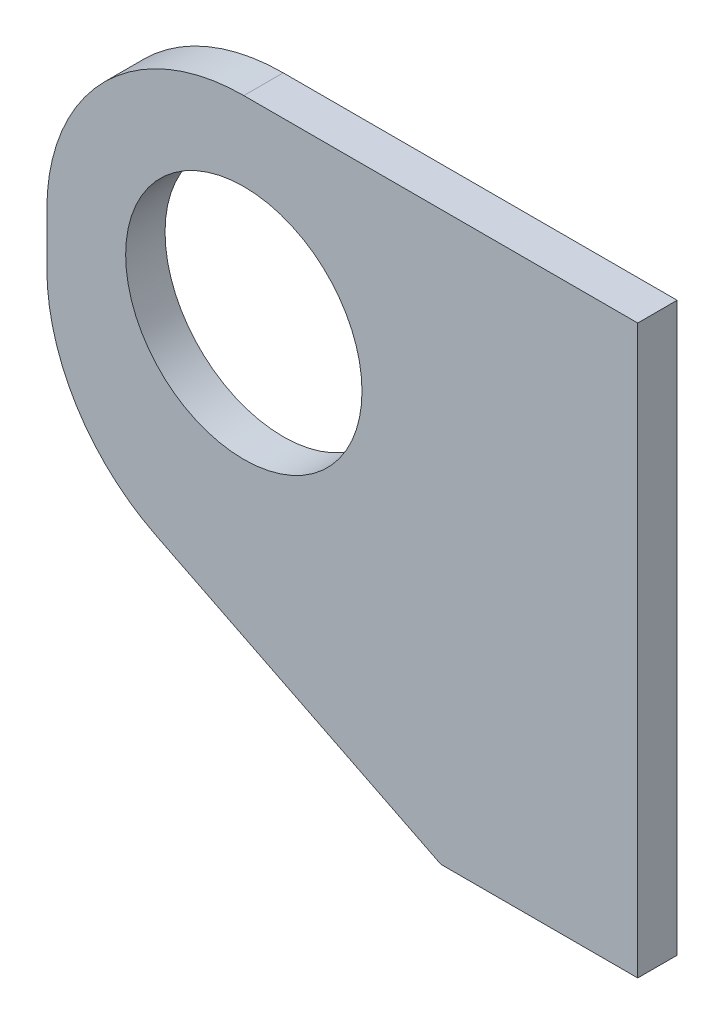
ISO-10303-21;
HEADER;
FILE_DESCRIPTION(('STEP AP214'),'2;1');
FILE_NAME('part.step','',(''),(''),'','','');
FILE_SCHEMA(('AUTOMOTIVE_DESIGN { 1 0 10303 214 1 1 1 1 }'));
ENDSEC;
DATA;
#1=APPLICATION_CONTEXT('core data for automotive mechanical design processes');
#2=APPLICATION_PROTOCOL_DEFINITION('international standard','automotive_design',2000,#1);
#3=PRODUCT_CONTEXT('',#1,'mechanical');
#4=PRODUCT('Part','Part','',(#3));
#5=PRODUCT_RELATED_PRODUCT_CATEGORY('part','',(#4));
#6=PRODUCT_DEFINITION_FORMATION('','',#4);
#7=PRODUCT_DEFINITION_CONTEXT('part definition',#1,'design');
#8=PRODUCT_DEFINITION('design','',#6,#7);
#9=PRODUCT_DEFINITION_SHAPE('','',#8);
#10=(LENGTH_UNIT() NAMED_UNIT(*) SI_UNIT(.MILLI.,.METRE.));
#11=(NAMED_UNIT(*) PLANE_ANGLE_UNIT() SI_UNIT($,.RADIAN.));
#12=(NAMED_UNIT(*) SI_UNIT($,.STERADIAN.) SOLID_ANGLE_UNIT());
#13=UNCERTAINTY_MEASURE_WITH_UNIT(LENGTH_MEASURE(1.E-05),#10,'distance_accuracy_value','');
#14=(GEOMETRIC_REPRESENTATION_CONTEXT(3) GLOBAL_UNCERTAINTY_ASSIGNED_CONTEXT((#13)) GLOBAL_UNIT_ASSIGNED_CONTEXT((#10,
#11,#12)) REPRESENTATION_CONTEXT('',''));
#15=CARTESIAN_POINT('',(0.,0.,0.));
#16=DIRECTION('',(0.,0.,1.));
#17=DIRECTION('',(1.,0.,0.));
#18=AXIS2_PLACEMENT_3D('',#15,#16,#17);
#19=CARTESIAN_POINT('',(0.,0.,5.));
#20=DIRECTION('',(0.,0.,1.));
#21=DIRECTION('',(1.,0.,0.));
#22=AXIS2_PLACEMENT_3D('',#19,#20,#21);
#23=PLANE('',#22);
#24=DIRECTION('',(0.,-1.,0.));
#25=VECTOR('',#24,1.);
#26=CARTESIAN_POINT('',(-150.,144.,5.));
#27=LINE('',#26,#25);
#28=CARTESIAN_POINT('',(-150.,94.,5.));
#29=VERTEX_POINT('',#28);
#30=CARTESIAN_POINT('',(-150.,80.9016994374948,5.));
#31=VERTEX_POINT('',#30);
#32=EDGE_CURVE('E135',#29,#31,#27,.T.);
#33=ORIENTED_EDGE('',*,*,#32,.T.);
#34=CARTESIAN_POINT('',(-100.,80.9016994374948,5.));
#35=DIRECTION('',(0.,0.,1.));
#36=DIRECTION('',(1.,0.,0.));
#37=AXIS2_PLACEMENT_3D('',#34,#35,#36);
#38=CIRCLE('',#37,50.);
#39=CARTESIAN_POINT('',(-122.360679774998,36.180339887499,5.));
#40=VERTEX_POINT('',#39);
#41=EDGE_CURVE('E40',#31,#40,#38,.T.);
#42=ORIENTED_EDGE('',*,*,#41,.T.);
#43=DIRECTION('',(0.894427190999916,-0.447213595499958,0.));
#44=VECTOR('',#43,1.);
#45=CARTESIAN_POINT('',(-150.,50.,5.));
#46=LINE('',#45,#44);
#47=CARTESIAN_POINT('',(-50.,0.,5.));
#48=VERTEX_POINT('',#47);
#49=EDGE_CURVE('E108',#40,#48,#46,.T.);
#50=ORIENTED_EDGE('',*,*,#49,.T.);
#51=DIRECTION('',(1.,0.,0.));
#52=VECTOR('',#51,1.);
#53=CARTESIAN_POINT('',(-50.,0.,5.));
#54=LINE('',#53,#52);
#55=CARTESIAN_POINT('',(0.,0.,5.));
#56=VERTEX_POINT('',#55);
#57=EDGE_CURVE('E103',#48,#56,#54,.T.);
#58=ORIENTED_EDGE('',*,*,#57,.T.);
#59=DIRECTION('',(0.,1.,0.));
#60=VECTOR('',#59,1.);
#61=CARTESIAN_POINT('',(0.,0.,5.));
#62=LINE('',#61,#60);
#63=CARTESIAN_POINT('',(0.,144.,5.));
#64=VERTEX_POINT('',#63);
#65=EDGE_CURVE('E93',#56,#64,#62,.T.);
#66=ORIENTED_EDGE('',*,*,#65,.T.);
#67=DIRECTION('',(-1.,0.,0.));
#68=VECTOR('',#67,1.);
#69=CARTESIAN_POINT('',(0.,144.,5.));
#70=LINE('',#69,#68);
#71=CARTESIAN_POINT('',(-100.,144.,5.));
#72=VERTEX_POINT('',#71);
#73=EDGE_CURVE('E102',#64,#72,#70,.T.);
#74=ORIENTED_EDGE('',*,*,#73,.T.);
#75=CARTESIAN_POINT('',(-100.,94.,5.));
#76=DIRECTION('',(0.,0.,1.));
#77=DIRECTION('',(1.,0.,0.));
#78=AXIS2_PLACEMENT_3D('',#75,#76,#77);
#79=CIRCLE('',#78,50.);
#80=EDGE_CURVE('E133',#72,#29,#79,.T.);
#81=ORIENTED_EDGE('',*,*,#80,.T.);
#82=EDGE_LOOP('',(#33,#42,#50,#58,#66,#74,#81));
#83=FACE_BOUND('',#82,.T.);
#84=CARTESIAN_POINT('',(-100.,94.,5.));
#85=DIRECTION('',(0.,0.,1.));
#86=DIRECTION('',(1.,0.,0.));
#87=AXIS2_PLACEMENT_3D('',#84,#85,#86);
#88=CIRCLE('',#87,30.);
#89=CARTESIAN_POINT('',(-70.,94.,5.));
#90=VERTEX_POINT('',#89);
#91=EDGE_CURVE('E157',#90,#90,#88,.T.);
#92=ORIENTED_EDGE('',*,*,#91,.F.);
#93=EDGE_LOOP('',(#92));
#94=FACE_BOUND('',#93,.T.);
#95=ADVANCED_FACE('F32',(#83,#94),#23,.T.);
#96=CARTESIAN_POINT('',(0.,0.,-5.));
#97=DIRECTION('',(0.,0.,1.));
#98=DIRECTION('',(1.,0.,0.));
#99=AXIS2_PLACEMENT_3D('',#96,#97,#98);
#100=PLANE('',#99);
#101=DIRECTION('',(0.894427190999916,-0.447213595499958,0.));
#102=VECTOR('',#101,1.);
#103=CARTESIAN_POINT('',(-150.,50.,-5.));
#104=LINE('',#103,#102);
#105=CARTESIAN_POINT('',(-122.360679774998,36.180339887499,-5.));
#106=VERTEX_POINT('',#105);
#107=CARTESIAN_POINT('',(-50.,0.,-5.));
#108=VERTEX_POINT('',#107);
#109=EDGE_CURVE('E112',#106,#108,#104,.T.);
#110=ORIENTED_EDGE('',*,*,#109,.F.);
#111=CARTESIAN_POINT('',(-100.,80.9016994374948,-5.));
#112=DIRECTION('',(0.,0.,1.));
#113=DIRECTION('',(1.,0.,0.));
#114=AXIS2_PLACEMENT_3D('',#111,#112,#113);
#115=CIRCLE('',#114,50.);
#116=CARTESIAN_POINT('',(-150.,80.9016994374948,-5.));
#117=VERTEX_POINT('',#116);
#118=EDGE_CURVE('E127',#106,#117,#115,.F.);
#119=ORIENTED_EDGE('',*,*,#118,.T.);
#120=DIRECTION('',(0.,-1.,0.));
#121=VECTOR('',#120,1.);
#122=CARTESIAN_POINT('',(-150.,144.,-5.));
#123=LINE('',#122,#121);
#124=CARTESIAN_POINT('',(-150.,94.,-5.));
#125=VERTEX_POINT('',#124);
#126=EDGE_CURVE('E147',#125,#117,#123,.T.);
#127=ORIENTED_EDGE('',*,*,#126,.F.);
#128=CARTESIAN_POINT('',(-100.,94.,-5.));
#129=DIRECTION('',(0.,0.,1.));
#130=DIRECTION('',(1.,0.,0.));
#131=AXIS2_PLACEMENT_3D('',#128,#129,#130);
#132=CIRCLE('',#131,50.);
#133=CARTESIAN_POINT('',(-100.,144.,-5.));
#134=VERTEX_POINT('',#133);
#135=EDGE_CURVE('E120',#125,#134,#132,.F.);
#136=ORIENTED_EDGE('',*,*,#135,.T.);
#137=DIRECTION('',(-1.,0.,0.));
#138=VECTOR('',#137,1.);
#139=CARTESIAN_POINT('',(0.,144.,-5.));
#140=LINE('',#139,#138);
#141=CARTESIAN_POINT('',(0.,144.,-5.));
#142=VERTEX_POINT('',#141);
#143=EDGE_CURVE('E150',#142,#134,#140,.T.);
#144=ORIENTED_EDGE('',*,*,#143,.F.);
#145=DIRECTION('',(0.,1.,0.));
#146=VECTOR('',#145,1.);
#147=CARTESIAN_POINT('',(0.,0.,-5.));
#148=LINE('',#147,#146);
#149=CARTESIAN_POINT('',(0.,0.,-5.));
#150=VERTEX_POINT('',#149);
#151=EDGE_CURVE('E153',#150,#142,#148,.T.);
#152=ORIENTED_EDGE('',*,*,#151,.F.);
#153=DIRECTION('',(1.,0.,0.));
#154=VECTOR('',#153,1.);
#155=CARTESIAN_POINT('',(-50.,0.,-5.));
#156=LINE('',#155,#154);
#157=EDGE_CURVE('E116',#108,#150,#156,.T.);
#158=ORIENTED_EDGE('',*,*,#157,.F.);
#159=EDGE_LOOP('',(#110,#119,#127,#136,#144,#152,#158));
#160=FACE_BOUND('',#159,.T.);
#161=CARTESIAN_POINT('',(-100.,94.,-5.));
#162=DIRECTION('',(0.,0.,1.));
#163=DIRECTION('',(1.,0.,0.));
#164=AXIS2_PLACEMENT_3D('',#161,#162,#163);
#165=CIRCLE('',#164,30.);
#166=CARTESIAN_POINT('',(-70.,94.,-5.));
#167=VERTEX_POINT('',#166);
#168=EDGE_CURVE('E160',#167,#167,#165,.T.);
#169=ORIENTED_EDGE('',*,*,#168,.T.);
#170=EDGE_LOOP('',(#169));
#171=FACE_BOUND('',#170,.T.);
#172=ADVANCED_FACE('F145',(#160,#171),#100,.F.);
#173=CARTESIAN_POINT('',(-50.,0.,5.));
#174=DIRECTION('',(0.,1.,0.));
#175=DIRECTION('',(0.,0.,1.));
#176=AXIS2_PLACEMENT_3D('',#173,#174,#175);
#177=PLANE('',#176);
#178=ORIENTED_EDGE('',*,*,#157,.T.);
#179=DIRECTION('',(0.,0.,-1.));
#180=VECTOR('',#179,1.);
#181=CARTESIAN_POINT('',(0.,0.,5.));
#182=LINE('',#181,#180);
#183=EDGE_CURVE('E97',#56,#150,#182,.T.);
#184=ORIENTED_EDGE('',*,*,#183,.F.);
#185=ORIENTED_EDGE('',*,*,#57,.F.);
#186=DIRECTION('',(0.,0.,-1.));
#187=VECTOR('',#186,1.);
#188=CARTESIAN_POINT('',(-50.,0.,5.));
#189=LINE('',#188,#187);
#190=EDGE_CURVE('E122',#48,#108,#189,.T.);
#191=ORIENTED_EDGE('',*,*,#190,.T.);
#192=EDGE_LOOP('',(#178,#184,#185,#191));
#193=FACE_BOUND('',#192,.T.);
#194=ADVANCED_FACE('F114',(#193),#177,.F.);
#195=CARTESIAN_POINT('',(0.,0.,5.));
#196=DIRECTION('',(-1.,0.,0.));
#197=DIRECTION('',(0.,0.,1.));
#198=AXIS2_PLACEMENT_3D('',#195,#196,#197);
#199=PLANE('',#198);
#200=ORIENTED_EDGE('',*,*,#151,.T.);
#201=DIRECTION('',(0.,0.,-1.));
#202=VECTOR('',#201,1.);
#203=CARTESIAN_POINT('',(0.,144.,5.));
#204=LINE('',#203,#202);
#205=EDGE_CURVE('E100',#64,#142,#204,.T.);
#206=ORIENTED_EDGE('',*,*,#205,.F.);
#207=ORIENTED_EDGE('',*,*,#65,.F.);
#208=ORIENTED_EDGE('',*,*,#183,.T.);
#209=EDGE_LOOP('',(#200,#206,#207,#208));
#210=FACE_BOUND('',#209,.T.);
#211=ADVANCED_FACE('F95',(#210),#199,.F.);
#212=CARTESIAN_POINT('',(0.,144.,5.));
#213=DIRECTION('',(0.,-1.,0.));
#214=DIRECTION('',(1.,0.,0.));
#215=AXIS2_PLACEMENT_3D('',#212,#213,#214);
#216=PLANE('',#215);
#217=ORIENTED_EDGE('',*,*,#143,.T.);
#218=DIRECTION('',(0.,0.,-1.));
#219=VECTOR('',#218,1.);
#220=CARTESIAN_POINT('',(-100.,144.,5.));
#221=LINE('',#220,#219);
#222=EDGE_CURVE('E11',#134,#72,#221,.F.);
#223=ORIENTED_EDGE('',*,*,#222,.T.);
#224=ORIENTED_EDGE('',*,*,#73,.F.);
#225=ORIENTED_EDGE('',*,*,#205,.T.);
#226=EDGE_LOOP('',(#217,#223,#224,#225));
#227=FACE_BOUND('',#226,.T.);
#228=ADVANCED_FACE('F186',(#227),#216,.F.);
#229=CARTESIAN_POINT('',(-150.,144.,5.));
#230=DIRECTION('',(1.,0.,0.));
#231=DIRECTION('',(0.,0.,-1.));
#232=AXIS2_PLACEMENT_3D('',#229,#230,#231);
#233=PLANE('',#232);
#234=ORIENTED_EDGE('',*,*,#126,.T.);
#235=DIRECTION('',(0.,0.,-1.));
#236=VECTOR('',#235,1.);
#237=CARTESIAN_POINT('',(-150.,80.9016994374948,5.));
#238=LINE('',#237,#236);
#239=EDGE_CURVE('E53',#117,#31,#238,.F.);
#240=ORIENTED_EDGE('',*,*,#239,.T.);
#241=ORIENTED_EDGE('',*,*,#32,.F.);
#242=DIRECTION('',(0.,0.,-1.));
#243=VECTOR('',#242,1.);
#244=CARTESIAN_POINT('',(-150.,94.,5.));
#245=LINE('',#244,#243);
#246=EDGE_CURVE('E129',#29,#125,#245,.T.);
#247=ORIENTED_EDGE('',*,*,#246,.T.);
#248=EDGE_LOOP('',(#234,#240,#241,#247));
#249=FACE_BOUND('',#248,.T.);
#250=ADVANCED_FACE('F148',(#249),#233,.F.);
#251=CARTESIAN_POINT('',(-150.,50.,5.));
#252=DIRECTION('',(0.447213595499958,0.894427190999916,0.));
#253=DIRECTION('',(-0.894427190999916,0.447213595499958,0.));
#254=AXIS2_PLACEMENT_3D('',#251,#252,#253);
#255=PLANE('',#254);
#256=ORIENTED_EDGE('',*,*,#49,.F.);
#257=DIRECTION('',(0.,0.,-1.));
#258=VECTOR('',#257,1.);
#259=CARTESIAN_POINT('',(-122.360679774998,36.180339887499,5.));
#260=LINE('',#259,#258);
#261=EDGE_CURVE('E117',#40,#106,#260,.T.);
#262=ORIENTED_EDGE('',*,*,#261,.T.);
#263=ORIENTED_EDGE('',*,*,#109,.T.);
#264=ORIENTED_EDGE('',*,*,#190,.F.);
#265=EDGE_LOOP('',(#256,#262,#263,#264));
#266=FACE_BOUND('',#265,.T.);
#267=ADVANCED_FACE('F139',(#266),#255,.F.);
#268=CARTESIAN_POINT('',(-100.,94.,5.));
#269=DIRECTION('',(0.,0.,-1.));
#270=DIRECTION('',(-1.,0.,0.));
#271=AXIS2_PLACEMENT_3D('',#268,#269,#270);
#272=CYLINDRICAL_SURFACE('',#271,30.);
#273=ORIENTED_EDGE('',*,*,#91,.T.);
#274=EDGE_LOOP('',(#273));
#275=FACE_BOUND('',#274,.T.);
#276=ORIENTED_EDGE('',*,*,#168,.F.);
#277=EDGE_LOOP('',(#276));
#278=FACE_BOUND('',#277,.T.);
#279=ADVANCED_FACE('F168',(#275,#278),#272,.F.);
#280=CARTESIAN_POINT('',(-100.,80.9016994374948,5.));
#281=DIRECTION('',(0.,0.,-1.));
#282=DIRECTION('',(-1.,0.,0.));
#283=AXIS2_PLACEMENT_3D('',#280,#281,#282);
#284=CYLINDRICAL_SURFACE('',#283,50.);
#285=ORIENTED_EDGE('',*,*,#41,.F.);
#286=ORIENTED_EDGE('',*,*,#239,.F.);
#287=ORIENTED_EDGE('',*,*,#118,.F.);
#288=ORIENTED_EDGE('',*,*,#261,.F.);
#289=EDGE_LOOP('',(#285,#286,#287,#288));
#290=FACE_BOUND('',#289,.T.);
#291=ADVANCED_FACE('F142',(#290),#284,.T.);
#292=CARTESIAN_POINT('',(-100.,94.,5.));
#293=DIRECTION('',(0.,0.,-1.));
#294=DIRECTION('',(-1.,0.,0.));
#295=AXIS2_PLACEMENT_3D('',#292,#293,#294);
#296=CYLINDRICAL_SURFACE('',#295,50.);
#297=ORIENTED_EDGE('',*,*,#80,.F.);
#298=ORIENTED_EDGE('',*,*,#222,.F.);
#299=ORIENTED_EDGE('',*,*,#135,.F.);
#300=ORIENTED_EDGE('',*,*,#246,.F.);
#301=EDGE_LOOP('',(#297,#298,#299,#300));
#302=FACE_BOUND('',#301,.T.);
#303=ADVANCED_FACE('F34',(#302),#296,.T.);
#304=CLOSED_SHELL('',(#95,#172,#194,#211,#228,#250,#267,#279,#291,#303));
#305=MANIFOLD_SOLID_BREP('B2',#304);
#306=ADVANCED_BREP_SHAPE_REPRESENTATION('',(#18,#305),#14);
#307=SHAPE_DEFINITION_REPRESENTATION(#9,#306);
ENDSEC;
END-ISO-10303-21;
